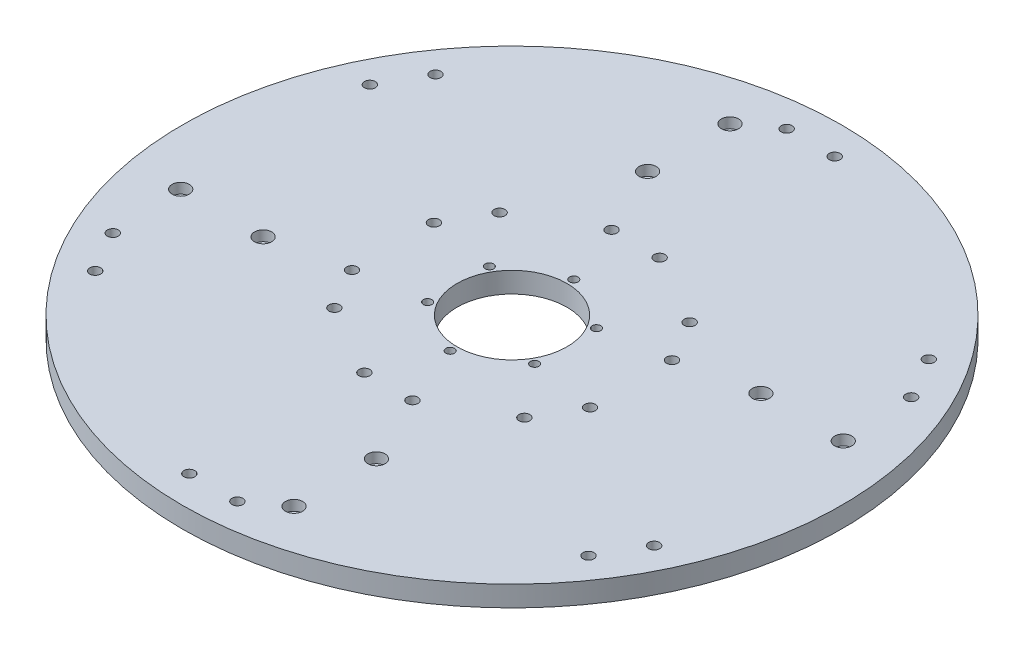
from build123d import *

# Parameters (mm, degrees)
SKETCH1_R                                        = 304.8
SKETCH1_R_2                                      = 50.8
EXTRUDE1_DEPTH                                   = 19.05
CBORE_FOR_3_8_SOCKET_HEAD_CAP_SCREW1_D           = 10.0838
CBORE_FOR_3_8_SOCKET_HEAD_CAP_SCREW1_CBORE_D     = 15.875
CBORE_FOR_3_8_SOCKET_HEAD_CAP_SCREW1_CBORE_DEPTH = 9.525
CIRPATTERN1_COUNT                                = 6
CBORE_FOR_3_8_SOCKET_HEAD_CAP_SCREW2_D           = 10.0838
CBORE_FOR_3_8_SOCKET_HEAD_CAP_SCREW2_CBORE_D     = 15.875
CBORE_FOR_3_8_SOCKET_HEAD_CAP_SCREW2_CBORE_DEPTH = 9.525
CIRPATTERN2_COUNT                                = 4
F_5_16_0_3125_DIAMETER_HOLE1_D                   = 7.9375
CIRPATTERN3_COUNT                                = 6
M5X0_8_TAPPED_HOLE1_D                            = 4.2
M5X0_8_TAPPED_HOLE1_DEPTH                        = 13.97
M5X0_8_TAPPED_HOLE1_TIP                          = 1.2618073


with BuildPart() as part:
    # Sketch1 → Extrude1 (new body)
    with BuildSketch(Plane(origin=(0, 0, 0), x_dir=(1, 0, 0), z_dir=(0, 1, 0))):
        with Locations(Location((0, 0, 0), (0, 0, 90))):
            Circle(SKETCH1_R)
        with Locations(Location((0, 0, 0), (0, 0, 90))):
            Circle(SKETCH1_R_2, mode=Mode.SUBTRACT)
    extrude(amount=EXTRUDE1_DEPTH)

    # CBORE for 3_8 Socket Head Cap Screw1 (through all)
    with Locations(Plane(origin=(108.72971843, 0, -101.906013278), x_dir=(-1, 0, 0), z_dir=(0, -1, 0))):
        with Locations((86.50471843, -216.206013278), (130.95471843, -378.131013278), (86.50471843, -378.131013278), (130.95471843, -216.206013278)):
            cbore_for_3_8_socket_head_cap_screw1 = CounterBoreHole(CBORE_FOR_3_8_SOCKET_HEAD_CAP_SCREW1_D / 2, CBORE_FOR_3_8_SOCKET_HEAD_CAP_SCREW1_CBORE_D / 2, CBORE_FOR_3_8_SOCKET_HEAD_CAP_SCREW1_CBORE_DEPTH)

    # CirPattern1: CBORE for 3_8 Socket Head Cap Screw1 ×6 about axis
    cirpattern1_axis = Axis((0, 0, 0), (0, 1, 0))
    for i in range(1, CIRPATTERN1_COUNT):
        add(cbore_for_3_8_socket_head_cap_screw1.rotate(cirpattern1_axis, i * 360 / CIRPATTERN1_COUNT), mode=Mode.SUBTRACT)

    # CBORE for 3_8 Socket Head Cap Screw2 (through all)
    with Locations(Plane(origin=(0, 19.05, 0), x_dir=(-1, 0, 0), z_dir=(0, 1, 0))):
        with Locations((-177.8, -52.3875), (-254, -52.3875)):
            cbore_for_3_8_socket_head_cap_screw2 = CounterBoreHole(CBORE_FOR_3_8_SOCKET_HEAD_CAP_SCREW2_D / 2, CBORE_FOR_3_8_SOCKET_HEAD_CAP_SCREW2_CBORE_D / 2, CBORE_FOR_3_8_SOCKET_HEAD_CAP_SCREW2_CBORE_DEPTH)

    # CirPattern2: CBORE for 3_8 Socket Head Cap Screw2 ×4 about axis
    cirpattern2_axis = Axis((0, 0, 0), (0, 1, 0))
    for i in range(1, CIRPATTERN2_COUNT):
        add(cbore_for_3_8_socket_head_cap_screw2.rotate(cirpattern2_axis, i * 360 / CIRPATTERN2_COUNT), mode=Mode.SUBTRACT)

    # 5_16 _0.3125_ Diameter Hole1 (through all)
    with Locations(Plane(origin=(0, 19.05, 0), x_dir=(-1, 0, 0), z_dir=(0, 1, 0))):
        with Locations((0, -57.15)):
            f_5_16_0_3125_diameter_hole1 = Hole(F_5_16_0_3125_DIAMETER_HOLE1_D / 2)

    # CirPattern3: 5_16 _0.3125_ Diameter Hole1 ×6 about axis
    cirpattern3_axis = Axis((0, 0, 0), (0, 1, 0))
    for i in range(1, CIRPATTERN3_COUNT):
        add(f_5_16_0_3125_diameter_hole1.rotate(cirpattern3_axis, i * 360 / CIRPATTERN3_COUNT), mode=Mode.SUBTRACT)

    # M5x0.8 Tapped Hole1
    with Locations(Plane.XZ):
        with Locations((-196.85, -177.8), (-112.412523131, -129.05), (-160.412523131, -45.911561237), (-244.85, -94.661561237)):
            Hole(M5X0_8_TAPPED_HOLE1_D / 2, depth=M5X0_8_TAPPED_HOLE1_DEPTH)
            with Locations((0, 0, -(M5X0_8_TAPPED_HOLE1_DEPTH + M5X0_8_TAPPED_HOLE1_TIP / 2))):  # 118° drill point
                Cone(0, M5X0_8_TAPPED_HOLE1_D / 2, M5X0_8_TAPPED_HOLE1_TIP, mode=Mode.SUBTRACT)


solid = part.part
